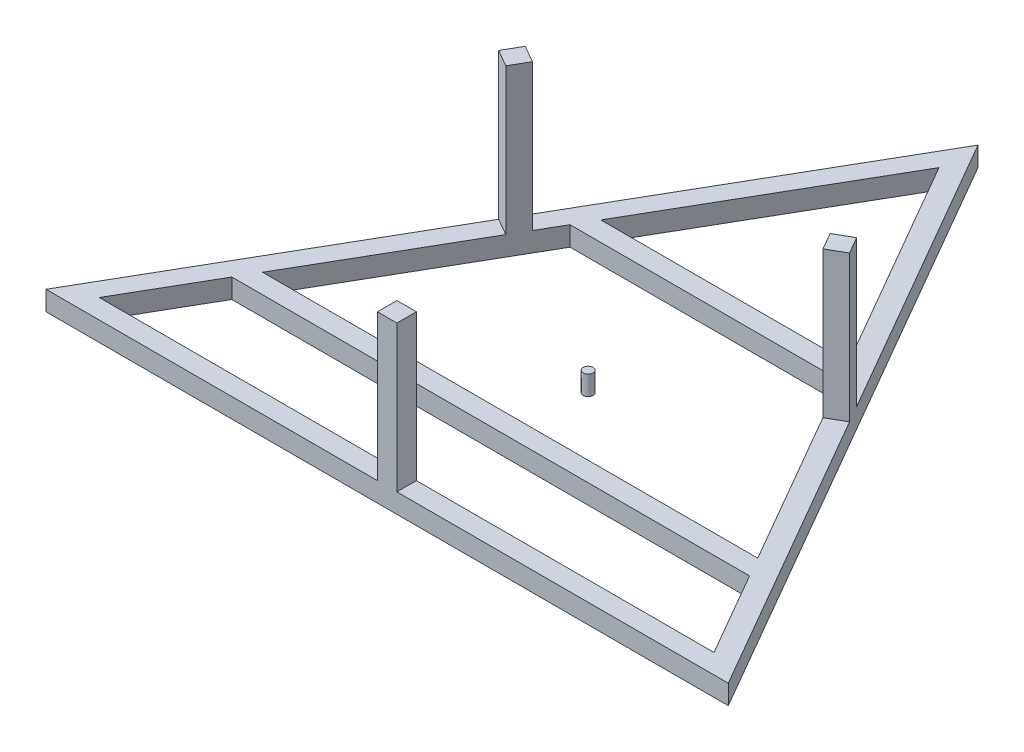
ISO-10303-21;
HEADER;
FILE_DESCRIPTION(('STEP AP214'),'2;1');
FILE_NAME('part.step','',(''),(''),'','','');
FILE_SCHEMA(('AUTOMOTIVE_DESIGN { 1 0 10303 214 1 1 1 1 }'));
ENDSEC;
DATA;
#1=APPLICATION_CONTEXT('core data for automotive mechanical design processes');
#2=APPLICATION_PROTOCOL_DEFINITION('international standard','automotive_design',2000,#1);
#3=PRODUCT_CONTEXT('',#1,'mechanical');
#4=PRODUCT('Part','Part','',(#3));
#5=PRODUCT_RELATED_PRODUCT_CATEGORY('part','',(#4));
#6=PRODUCT_DEFINITION_FORMATION('','',#4);
#7=PRODUCT_DEFINITION_CONTEXT('part definition',#1,'design');
#8=PRODUCT_DEFINITION('design','',#6,#7);
#9=PRODUCT_DEFINITION_SHAPE('','',#8);
#10=(LENGTH_UNIT() NAMED_UNIT(*) SI_UNIT(.MILLI.,.METRE.));
#11=(NAMED_UNIT(*) PLANE_ANGLE_UNIT() SI_UNIT($,.RADIAN.));
#12=(NAMED_UNIT(*) SI_UNIT($,.STERADIAN.) SOLID_ANGLE_UNIT());
#13=UNCERTAINTY_MEASURE_WITH_UNIT(LENGTH_MEASURE(1.E-05),#10,'distance_accuracy_value','');
#14=(GEOMETRIC_REPRESENTATION_CONTEXT(3) GLOBAL_UNCERTAINTY_ASSIGNED_CONTEXT((#13)) GLOBAL_UNIT_ASSIGNED_CONTEXT((#10,
#11,#12)) REPRESENTATION_CONTEXT('',''));
#15=CARTESIAN_POINT('',(0.,0.,0.));
#16=DIRECTION('',(0.,0.,1.));
#17=DIRECTION('',(1.,0.,0.));
#18=AXIS2_PLACEMENT_3D('',#15,#16,#17);
#19=CARTESIAN_POINT('',(0.,0.,0.));
#20=DIRECTION('',(0.,1.,0.));
#21=DIRECTION('',(0.,0.,1.));
#22=AXIS2_PLACEMENT_3D('',#19,#20,#21);
#23=CYLINDRICAL_SURFACE('',#22,5.);
#24=CARTESIAN_POINT('',(0.,0.,0.));
#25=DIRECTION('',(0.,1.,0.));
#26=DIRECTION('',(0.,0.,1.));
#27=AXIS2_PLACEMENT_3D('',#24,#25,#26);
#28=CIRCLE('',#27,5.);
#29=CARTESIAN_POINT('',(0.,0.,5.));
#30=VERTEX_POINT('',#29);
#31=EDGE_CURVE('E11',#30,#30,#28,.T.);
#32=ORIENTED_EDGE('',*,*,#31,.T.);
#33=EDGE_LOOP('',(#32));
#34=FACE_BOUND('',#33,.T.);
#35=CARTESIAN_POINT('',(0.,20.,0.));
#36=DIRECTION('',(0.,1.,0.));
#37=DIRECTION('',(0.,0.,1.));
#38=AXIS2_PLACEMENT_3D('',#35,#36,#37);
#39=CIRCLE('',#38,5.);
#40=CARTESIAN_POINT('',(0.,20.,5.));
#41=VERTEX_POINT('',#40);
#42=EDGE_CURVE('E44',#41,#41,#39,.T.);
#43=ORIENTED_EDGE('',*,*,#42,.F.);
#44=EDGE_LOOP('',(#43));
#45=FACE_BOUND('',#44,.T.);
#46=ADVANCED_FACE('F41',(#34,#45),#23,.T.);
#47=CARTESIAN_POINT('',(0.,0.,0.));
#48=DIRECTION('',(0.,1.,0.));
#49=DIRECTION('',(0.,0.,1.));
#50=AXIS2_PLACEMENT_3D('',#47,#48,#49);
#51=PLANE('',#50);
#52=ORIENTED_EDGE('',*,*,#31,.F.);
#53=EDGE_LOOP('',(#52));
#54=FACE_BOUND('',#53,.T.);
#55=ADVANCED_FACE('F56',(#54),#51,.F.);
#56=CARTESIAN_POINT('',(0.,20.,0.));
#57=DIRECTION('',(0.,1.,0.));
#58=DIRECTION('',(0.,0.,1.));
#59=AXIS2_PLACEMENT_3D('',#56,#57,#58);
#60=PLANE('',#59);
#61=ORIENTED_EDGE('',*,*,#42,.T.);
#62=EDGE_LOOP('',(#61));
#63=FACE_BOUND('',#62,.T.);
#64=ADVANCED_FACE('F53',(#63),#60,.T.);
#65=CLOSED_SHELL('',(#46,#55,#64));
#66=MANIFOLD_SOLID_BREP('B2',#65);
#67=CARTESIAN_POINT('',(0.,20.,0.));
#68=DIRECTION('',(0.,1.,0.));
#69=DIRECTION('',(0.,0.,1.));
#70=AXIS2_PLACEMENT_3D('',#67,#68,#69);
#71=PLANE('',#70);
#72=DIRECTION('',(1.,0.,0.));
#73=VECTOR('',#72,1.);
#74=CARTESIAN_POINT('',(-350.,20.,206.217782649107));
#75=LINE('',#74,#73);
#76=CARTESIAN_POINT('',(-350.,20.,206.217782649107));
#77=VERTEX_POINT('',#76);
#78=CARTESIAN_POINT('',(-9.99999999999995,20.,206.217782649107));
#79=VERTEX_POINT('',#78);
#80=EDGE_CURVE('E426',#77,#79,#75,.T.);
#81=ORIENTED_EDGE('',*,*,#80,.T.);
#82=DIRECTION('',(0.,0.,1.));
#83=VECTOR('',#82,1.);
#84=CARTESIAN_POINT('',(-9.99999999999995,20.,186.217782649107));
#85=LINE('',#84,#83);
#86=CARTESIAN_POINT('',(-9.99999999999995,20.,186.217782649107));
#87=VERTEX_POINT('',#86);
#88=EDGE_CURVE('E486',#87,#79,#85,.T.);
#89=ORIENTED_EDGE('',*,*,#88,.F.);
#90=DIRECTION('',(1.,0.,0.));
#91=VECTOR('',#90,1.);
#92=CARTESIAN_POINT('',(-315.358983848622,20.,186.217782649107));
#93=LINE('',#92,#91);
#94=CARTESIAN_POINT('',(-315.358983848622,20.,186.217782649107));
#95=VERTEX_POINT('',#94);
#96=EDGE_CURVE('E278',#95,#87,#93,.T.);
#97=ORIENTED_EDGE('',*,*,#96,.F.);
#98=DIRECTION('',(-0.5,0.,0.866025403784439));
#99=VECTOR('',#98,1.);
#100=CARTESIAN_POINT('',(-265.581123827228,20.,100.));
#101=LINE('',#100,#99);
#102=CARTESIAN_POINT('',(-265.581123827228,20.,100.));
#103=VERTEX_POINT('',#102);
#104=EDGE_CURVE('E398',#103,#95,#101,.T.);
#105=ORIENTED_EDGE('',*,*,#104,.F.);
#106=DIRECTION('',(-1.,0.,0.));
#107=VECTOR('',#106,1.);
#108=CARTESIAN_POINT('',(-265.581123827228,20.,100.));
#109=LINE('',#108,#107);
#110=CARTESIAN_POINT('',(265.581123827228,20.,100.));
#111=VERTEX_POINT('',#110);
#112=EDGE_CURVE('E395',#111,#103,#109,.T.);
#113=ORIENTED_EDGE('',*,*,#112,.F.);
#114=DIRECTION('',(-0.500000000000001,0.,-0.866025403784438));
#115=VECTOR('',#114,1.);
#116=CARTESIAN_POINT('',(315.358983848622,20.,186.217782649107));
#117=LINE('',#116,#115);
#118=CARTESIAN_POINT('',(315.358983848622,20.,186.217782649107));
#119=VERTEX_POINT('',#118);
#120=EDGE_CURVE('E392',#119,#111,#117,.T.);
#121=ORIENTED_EDGE('',*,*,#120,.F.);
#122=CARTESIAN_POINT('',(10.,20.,186.217782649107));
#123=VERTEX_POINT('',#122);
#124=EDGE_CURVE('E393',#123,#119,#93,.T.);
#125=ORIENTED_EDGE('',*,*,#124,.F.);
#126=DIRECTION('',(0.,0.,-1.));
#127=VECTOR('',#126,1.);
#128=CARTESIAN_POINT('',(10.,20.,186.217782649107));
#129=LINE('',#128,#127);
#130=CARTESIAN_POINT('',(10.,20.,206.217782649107));
#131=VERTEX_POINT('',#130);
#132=EDGE_CURVE('E272',#131,#123,#129,.T.);
#133=ORIENTED_EDGE('',*,*,#132,.F.);
#134=CARTESIAN_POINT('',(350.,20.,206.217782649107));
#135=VERTEX_POINT('',#134);
#136=EDGE_CURVE('E424',#131,#135,#75,.T.);
#137=ORIENTED_EDGE('',*,*,#136,.T.);
#138=DIRECTION('',(-0.5,0.,-0.866025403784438));
#139=VECTOR('',#138,1.);
#140=CARTESIAN_POINT('',(350.,20.,206.217782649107));
#141=LINE('',#140,#139);
#142=CARTESIAN_POINT('',(180.,20.,-88.2308546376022));
#143=VERTEX_POINT('',#142);
#144=EDGE_CURVE('E430',#135,#143,#141,.T.);
#145=ORIENTED_EDGE('',*,*,#144,.T.);
#146=DIRECTION('',(0.866025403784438,0.,-0.500000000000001));
#147=VECTOR('',#146,1.);
#148=CARTESIAN_POINT('',(180.,20.,-88.2308546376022));
#149=LINE('',#148,#147);
#150=CARTESIAN_POINT('',(162.679491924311,20.,-78.2308546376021));
#151=VERTEX_POINT('',#150);
#152=EDGE_CURVE('E281',#151,#143,#149,.T.);
#153=ORIENTED_EDGE('',*,*,#152,.F.);
#154=DIRECTION('',(-0.5,0.,-0.866025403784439));
#155=VECTOR('',#154,1.);
#156=CARTESIAN_POINT('',(254.034118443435,20.,80.));
#157=LINE('',#156,#155);
#158=CARTESIAN_POINT('',(254.034118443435,20.,80.));
#159=VERTEX_POINT('',#158);
#160=EDGE_CURVE('E340',#159,#151,#157,.T.);
#161=ORIENTED_EDGE('',*,*,#160,.F.);
#162=DIRECTION('',(1.,0.,0.));
#163=VECTOR('',#162,1.);
#164=CARTESIAN_POINT('',(-254.034118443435,20.,80.));
#165=LINE('',#164,#163);
#166=CARTESIAN_POINT('',(-254.034118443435,20.,80.));
#167=VERTEX_POINT('',#166);
#168=EDGE_CURVE('E336',#167,#159,#165,.T.);
#169=ORIENTED_EDGE('',*,*,#168,.F.);
#170=DIRECTION('',(-0.5,0.,0.866025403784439));
#171=VECTOR('',#170,1.);
#172=CARTESIAN_POINT('',(-138.56406460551,20.,-120.));
#173=LINE('',#172,#171);
#174=CARTESIAN_POINT('',(-162.679491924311,20.,-78.2308546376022));
#175=VERTEX_POINT('',#174);
#176=EDGE_CURVE('E337',#175,#167,#173,.T.);
#177=ORIENTED_EDGE('',*,*,#176,.F.);
#178=DIRECTION('',(0.866025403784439,0.,0.499999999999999));
#179=VECTOR('',#178,1.);
#180=CARTESIAN_POINT('',(-162.679491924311,20.,-78.2308546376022));
#181=LINE('',#180,#179);
#182=CARTESIAN_POINT('',(-180.,20.,-88.2308546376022));
#183=VERTEX_POINT('',#182);
#184=EDGE_CURVE('E310',#183,#175,#181,.T.);
#185=ORIENTED_EDGE('',*,*,#184,.F.);
#186=DIRECTION('',(-0.5,0.,0.866025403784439));
#187=VECTOR('',#186,1.);
#188=CARTESIAN_POINT('',(0.,20.,-400.));
#189=LINE('',#188,#187);
#190=EDGE_CURVE('E425',#183,#77,#189,.T.);
#191=ORIENTED_EDGE('',*,*,#190,.T.);
#192=EDGE_LOOP('',(#81,#89,#97,#105,#113,#121,#125,#133,#137,#145,#153,#161,#169,#177,#185,#191));
#193=FACE_BOUND('',#192,.T.);
#194=ADVANCED_FACE('F82',(#193),#71,.T.);
#195=DIRECTION('',(-0.5,0.,0.866025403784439));
#196=VECTOR('',#195,1.);
#197=CARTESIAN_POINT('',(0.,20.,-360.));
#198=LINE('',#197,#196);
#199=CARTESIAN_POINT('',(0.,20.,-360.));
#200=VERTEX_POINT('',#199);
#201=CARTESIAN_POINT('',(-127.017059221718,20.,-140.));
#202=VERTEX_POINT('',#201);
#203=EDGE_CURVE('E369',#200,#202,#198,.T.);
#204=ORIENTED_EDGE('',*,*,#203,.F.);
#205=DIRECTION('',(-0.5,0.,-0.866025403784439));
#206=VECTOR('',#205,1.);
#207=CARTESIAN_POINT('',(127.017059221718,20.,-140.));
#208=LINE('',#207,#206);
#209=CARTESIAN_POINT('',(127.017059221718,20.,-140.));
#210=VERTEX_POINT('',#209);
#211=EDGE_CURVE('E367',#210,#200,#208,.T.);
#212=ORIENTED_EDGE('',*,*,#211,.F.);
#213=DIRECTION('',(1.,0.,0.));
#214=VECTOR('',#213,1.);
#215=CARTESIAN_POINT('',(-127.017059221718,20.,-140.));
#216=LINE('',#215,#214);
#217=EDGE_CURVE('E373',#202,#210,#216,.T.);
#218=ORIENTED_EDGE('',*,*,#217,.F.);
#219=EDGE_LOOP('',(#204,#212,#218));
#220=FACE_BOUND('',#219,.T.);
#221=CARTESIAN_POINT('',(152.679491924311,20.,-95.551362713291));
#222=VERTEX_POINT('',#221);
#223=CARTESIAN_POINT('',(138.56406460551,20.,-120.));
#224=VERTEX_POINT('',#223);
#225=EDGE_CURVE('E339',#222,#224,#157,.T.);
#226=ORIENTED_EDGE('',*,*,#225,.F.);
#227=DIRECTION('',(-0.866025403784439,0.,0.5));
#228=VECTOR('',#227,1.);
#229=CARTESIAN_POINT('',(170.,20.,-105.551362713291));
#230=LINE('',#229,#228);
#231=CARTESIAN_POINT('',(170.,20.,-105.551362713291));
#232=VERTEX_POINT('',#231);
#233=EDGE_CURVE('E279',#232,#222,#230,.T.);
#234=ORIENTED_EDGE('',*,*,#233,.F.);
#235=CARTESIAN_POINT('',(0.,20.,-400.));
#236=VERTEX_POINT('',#235);
#237=EDGE_CURVE('E429',#232,#236,#141,.T.);
#238=ORIENTED_EDGE('',*,*,#237,.T.);
#239=CARTESIAN_POINT('',(-170.,20.,-105.551362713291));
#240=VERTEX_POINT('',#239);
#241=EDGE_CURVE('E422',#236,#240,#189,.T.);
#242=ORIENTED_EDGE('',*,*,#241,.T.);
#243=DIRECTION('',(-0.866025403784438,0.,-0.500000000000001));
#244=VECTOR('',#243,1.);
#245=CARTESIAN_POINT('',(-152.679491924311,20.,-95.5513627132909));
#246=LINE('',#245,#244);
#247=CARTESIAN_POINT('',(-152.679491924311,20.,-95.5513627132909));
#248=VERTEX_POINT('',#247);
#249=EDGE_CURVE('E305',#248,#240,#246,.T.);
#250=ORIENTED_EDGE('',*,*,#249,.F.);
#251=CARTESIAN_POINT('',(-138.56406460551,20.,-120.));
#252=VERTEX_POINT('',#251);
#253=EDGE_CURVE('E333',#252,#248,#173,.T.);
#254=ORIENTED_EDGE('',*,*,#253,.F.);
#255=DIRECTION('',(-1.,0.,0.));
#256=VECTOR('',#255,1.);
#257=CARTESIAN_POINT('',(-138.56406460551,20.,-120.));
#258=LINE('',#257,#256);
#259=EDGE_CURVE('E343',#224,#252,#258,.T.);
#260=ORIENTED_EDGE('',*,*,#259,.F.);
#261=EDGE_LOOP('',(#226,#234,#238,#242,#250,#254,#260));
#262=FACE_BOUND('',#261,.T.);
#263=ADVANCED_FACE('F464',(#220,#262),#71,.T.);
#264=CARTESIAN_POINT('',(0.,0.,0.));
#265=DIRECTION('',(0.,1.,0.));
#266=DIRECTION('',(0.,0.,1.));
#267=AXIS2_PLACEMENT_3D('',#264,#265,#266);
#268=PLANE('',#267);
#269=DIRECTION('',(-0.5,0.,-0.866025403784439));
#270=VECTOR('',#269,1.);
#271=CARTESIAN_POINT('',(127.017059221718,0.,-140.));
#272=LINE('',#271,#270);
#273=CARTESIAN_POINT('',(127.017059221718,0.,-140.));
#274=VERTEX_POINT('',#273);
#275=CARTESIAN_POINT('',(0.,0.,-360.));
#276=VERTEX_POINT('',#275);
#277=EDGE_CURVE('E366',#274,#276,#272,.T.);
#278=ORIENTED_EDGE('',*,*,#277,.T.);
#279=DIRECTION('',(-0.5,0.,0.866025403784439));
#280=VECTOR('',#279,1.);
#281=CARTESIAN_POINT('',(0.,0.,-360.));
#282=LINE('',#281,#280);
#283=CARTESIAN_POINT('',(-127.017059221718,0.,-140.));
#284=VERTEX_POINT('',#283);
#285=EDGE_CURVE('E378',#276,#284,#282,.T.);
#286=ORIENTED_EDGE('',*,*,#285,.T.);
#287=DIRECTION('',(1.,0.,0.));
#288=VECTOR('',#287,1.);
#289=CARTESIAN_POINT('',(-127.017059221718,0.,-140.));
#290=LINE('',#289,#288);
#291=EDGE_CURVE('E370',#284,#274,#290,.T.);
#292=ORIENTED_EDGE('',*,*,#291,.T.);
#293=EDGE_LOOP('',(#278,#286,#292));
#294=FACE_BOUND('',#293,.T.);
#295=DIRECTION('',(-0.5,0.,0.866025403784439));
#296=VECTOR('',#295,1.);
#297=CARTESIAN_POINT('',(0.,0.,-400.));
#298=LINE('',#297,#296);
#299=CARTESIAN_POINT('',(0.,0.,-400.));
#300=VERTEX_POINT('',#299);
#301=CARTESIAN_POINT('',(-350.,0.,206.217782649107));
#302=VERTEX_POINT('',#301);
#303=EDGE_CURVE('E421',#300,#302,#298,.T.);
#304=ORIENTED_EDGE('',*,*,#303,.F.);
#305=DIRECTION('',(-0.5,0.,-0.866025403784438));
#306=VECTOR('',#305,1.);
#307=CARTESIAN_POINT('',(350.,0.,206.217782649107));
#308=LINE('',#307,#306);
#309=CARTESIAN_POINT('',(350.,0.,206.217782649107));
#310=VERTEX_POINT('',#309);
#311=EDGE_CURVE('E438',#310,#300,#308,.T.);
#312=ORIENTED_EDGE('',*,*,#311,.F.);
#313=DIRECTION('',(1.,0.,0.));
#314=VECTOR('',#313,1.);
#315=CARTESIAN_POINT('',(-350.,0.,206.217782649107));
#316=LINE('',#315,#314);
#317=EDGE_CURVE('E436',#302,#310,#316,.T.);
#318=ORIENTED_EDGE('',*,*,#317,.F.);
#319=EDGE_LOOP('',(#304,#312,#318));
#320=FACE_BOUND('',#319,.T.);
#321=DIRECTION('',(1.,0.,0.));
#322=VECTOR('',#321,1.);
#323=CARTESIAN_POINT('',(-315.358983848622,0.,186.217782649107));
#324=LINE('',#323,#322);
#325=CARTESIAN_POINT('',(-315.358983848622,0.,186.217782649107));
#326=VERTEX_POINT('',#325);
#327=CARTESIAN_POINT('',(315.358983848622,0.,186.217782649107));
#328=VERTEX_POINT('',#327);
#329=EDGE_CURVE('E390',#326,#328,#324,.T.);
#330=ORIENTED_EDGE('',*,*,#329,.T.);
#331=DIRECTION('',(-0.500000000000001,0.,-0.866025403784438));
#332=VECTOR('',#331,1.);
#333=CARTESIAN_POINT('',(315.358983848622,0.,186.217782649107));
#334=LINE('',#333,#332);
#335=CARTESIAN_POINT('',(265.581123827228,0.,100.));
#336=VERTEX_POINT('',#335);
#337=EDGE_CURVE('E403',#328,#336,#334,.T.);
#338=ORIENTED_EDGE('',*,*,#337,.T.);
#339=DIRECTION('',(-1.,0.,0.));
#340=VECTOR('',#339,1.);
#341=CARTESIAN_POINT('',(-265.581123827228,0.,100.));
#342=LINE('',#341,#340);
#343=CARTESIAN_POINT('',(-265.581123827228,0.,100.));
#344=VERTEX_POINT('',#343);
#345=EDGE_CURVE('E406',#336,#344,#342,.T.);
#346=ORIENTED_EDGE('',*,*,#345,.T.);
#347=DIRECTION('',(-0.5,0.,0.866025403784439));
#348=VECTOR('',#347,1.);
#349=CARTESIAN_POINT('',(-265.581123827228,0.,100.));
#350=LINE('',#349,#348);
#351=EDGE_CURVE('E409',#344,#326,#350,.T.);
#352=ORIENTED_EDGE('',*,*,#351,.T.);
#353=EDGE_LOOP('',(#330,#338,#346,#352));
#354=FACE_BOUND('',#353,.T.);
#355=DIRECTION('',(-0.5,0.,0.866025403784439));
#356=VECTOR('',#355,1.);
#357=CARTESIAN_POINT('',(-138.56406460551,0.,-120.));
#358=LINE('',#357,#356);
#359=CARTESIAN_POINT('',(-138.56406460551,0.,-120.));
#360=VERTEX_POINT('',#359);
#361=CARTESIAN_POINT('',(-254.034118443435,0.,80.));
#362=VERTEX_POINT('',#361);
#363=EDGE_CURVE('E332',#360,#362,#358,.T.);
#364=ORIENTED_EDGE('',*,*,#363,.T.);
#365=DIRECTION('',(1.,0.,0.));
#366=VECTOR('',#365,1.);
#367=CARTESIAN_POINT('',(-254.034118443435,0.,80.));
#368=LINE('',#367,#366);
#369=CARTESIAN_POINT('',(254.034118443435,0.,80.));
#370=VERTEX_POINT('',#369);
#371=EDGE_CURVE('E348',#362,#370,#368,.T.);
#372=ORIENTED_EDGE('',*,*,#371,.T.);
#373=DIRECTION('',(-0.5,0.,-0.866025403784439));
#374=VECTOR('',#373,1.);
#375=CARTESIAN_POINT('',(254.034118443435,0.,80.));
#376=LINE('',#375,#374);
#377=CARTESIAN_POINT('',(138.56406460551,0.,-120.));
#378=VERTEX_POINT('',#377);
#379=EDGE_CURVE('E351',#370,#378,#376,.T.);
#380=ORIENTED_EDGE('',*,*,#379,.T.);
#381=DIRECTION('',(-1.,0.,0.));
#382=VECTOR('',#381,1.);
#383=CARTESIAN_POINT('',(-138.56406460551,0.,-120.));
#384=LINE('',#383,#382);
#385=EDGE_CURVE('E354',#378,#360,#384,.T.);
#386=ORIENTED_EDGE('',*,*,#385,.T.);
#387=EDGE_LOOP('',(#364,#372,#380,#386));
#388=FACE_BOUND('',#387,.T.);
#389=ADVANCED_FACE('F452',(#294,#320,#354,#388),#268,.F.);
#390=CARTESIAN_POINT('',(0.,20.,-400.));
#391=DIRECTION('',(0.866025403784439,0.,0.5));
#392=DIRECTION('',(0.5,0.,-0.866025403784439));
#393=AXIS2_PLACEMENT_3D('',#390,#391,#392);
#394=PLANE('',#393);
#395=ORIENTED_EDGE('',*,*,#303,.T.);
#396=DIRECTION('',(0.,-1.,0.));
#397=VECTOR('',#396,1.);
#398=CARTESIAN_POINT('',(-350.,20.,206.217782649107));
#399=LINE('',#398,#397);
#400=EDGE_CURVE('E39',#77,#302,#399,.T.);
#401=ORIENTED_EDGE('',*,*,#400,.F.);
#402=ORIENTED_EDGE('',*,*,#190,.F.);
#403=DIRECTION('',(0.,-1.,0.));
#404=VECTOR('',#403,1.);
#405=CARTESIAN_POINT('',(-180.,170.,-88.2308546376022));
#406=LINE('',#405,#404);
#407=CARTESIAN_POINT('',(-180.,170.,-88.2308546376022));
#408=VERTEX_POINT('',#407);
#409=EDGE_CURVE('E323',#408,#183,#406,.T.);
#410=ORIENTED_EDGE('',*,*,#409,.F.);
#411=DIRECTION('',(-0.499999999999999,0.,0.866025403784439));
#412=VECTOR('',#411,1.);
#413=CARTESIAN_POINT('',(-170.,170.,-105.551362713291));
#414=LINE('',#413,#412);
#415=CARTESIAN_POINT('',(-170.,170.,-105.551362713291));
#416=VERTEX_POINT('',#415);
#417=EDGE_CURVE('E312',#416,#408,#414,.T.);
#418=ORIENTED_EDGE('',*,*,#417,.F.);
#419=DIRECTION('',(0.,-1.,0.));
#420=VECTOR('',#419,1.);
#421=CARTESIAN_POINT('',(-170.,170.,-105.551362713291));
#422=LINE('',#421,#420);
#423=EDGE_CURVE('E326',#416,#240,#422,.T.);
#424=ORIENTED_EDGE('',*,*,#423,.T.);
#425=ORIENTED_EDGE('',*,*,#241,.F.);
#426=DIRECTION('',(0.,-1.,0.));
#427=VECTOR('',#426,1.);
#428=CARTESIAN_POINT('',(0.,20.,-400.));
#429=LINE('',#428,#427);
#430=EDGE_CURVE('E433',#236,#300,#429,.T.);
#431=ORIENTED_EDGE('',*,*,#430,.T.);
#432=EDGE_LOOP('',(#395,#401,#402,#410,#418,#424,#425,#431));
#433=FACE_BOUND('',#432,.T.);
#434=ADVANCED_FACE('F84',(#433),#394,.F.);
#435=CARTESIAN_POINT('',(-350.,20.,206.217782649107));
#436=DIRECTION('',(0.,0.,-1.));
#437=DIRECTION('',(-1.,0.,0.));
#438=AXIS2_PLACEMENT_3D('',#435,#436,#437);
#439=PLANE('',#438);
#440=ORIENTED_EDGE('',*,*,#317,.T.);
#441=DIRECTION('',(0.,-1.,0.));
#442=VECTOR('',#441,1.);
#443=CARTESIAN_POINT('',(350.,20.,206.217782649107));
#444=LINE('',#443,#442);
#445=EDGE_CURVE('E90',#135,#310,#444,.T.);
#446=ORIENTED_EDGE('',*,*,#445,.F.);
#447=ORIENTED_EDGE('',*,*,#136,.F.);
#448=DIRECTION('',(0.,-1.,0.));
#449=VECTOR('',#448,1.);
#450=CARTESIAN_POINT('',(10.,170.,206.217782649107));
#451=LINE('',#450,#449);
#452=CARTESIAN_POINT('',(10.,170.,206.217782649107));
#453=VERTEX_POINT('',#452);
#454=EDGE_CURVE('E283',#453,#131,#451,.T.);
#455=ORIENTED_EDGE('',*,*,#454,.F.);
#456=DIRECTION('',(1.,0.,0.));
#457=VECTOR('',#456,1.);
#458=CARTESIAN_POINT('',(10.,170.,206.217782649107));
#459=LINE('',#458,#457);
#460=CARTESIAN_POINT('',(-9.99999999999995,170.,206.217782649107));
#461=VERTEX_POINT('',#460);
#462=EDGE_CURVE('E266',#461,#453,#459,.T.);
#463=ORIENTED_EDGE('',*,*,#462,.F.);
#464=DIRECTION('',(0.,-1.,0.));
#465=VECTOR('',#464,1.);
#466=CARTESIAN_POINT('',(-9.99999999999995,170.,206.217782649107));
#467=LINE('',#466,#465);
#468=EDGE_CURVE('E263',#461,#79,#467,.T.);
#469=ORIENTED_EDGE('',*,*,#468,.T.);
#470=ORIENTED_EDGE('',*,*,#80,.F.);
#471=ORIENTED_EDGE('',*,*,#400,.T.);
#472=EDGE_LOOP('',(#440,#446,#447,#455,#463,#469,#470,#471));
#473=FACE_BOUND('',#472,.T.);
#474=ADVANCED_FACE('F479',(#473),#439,.F.);
#475=CARTESIAN_POINT('',(350.,20.,206.217782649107));
#476=DIRECTION('',(-0.866025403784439,0.,0.5));
#477=DIRECTION('',(0.5,0.,0.866025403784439));
#478=AXIS2_PLACEMENT_3D('',#475,#476,#477);
#479=PLANE('',#478);
#480=ORIENTED_EDGE('',*,*,#311,.T.);
#481=ORIENTED_EDGE('',*,*,#430,.F.);
#482=ORIENTED_EDGE('',*,*,#237,.F.);
#483=DIRECTION('',(0.,-1.,0.));
#484=VECTOR('',#483,1.);
#485=CARTESIAN_POINT('',(170.,170.,-105.551362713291));
#486=LINE('',#485,#484);
#487=CARTESIAN_POINT('',(170.,170.,-105.551362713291));
#488=VERTEX_POINT('',#487);
#489=EDGE_CURVE('E303',#488,#232,#486,.T.);
#490=ORIENTED_EDGE('',*,*,#489,.F.);
#491=DIRECTION('',(-0.500000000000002,0.,-0.866025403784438));
#492=VECTOR('',#491,1.);
#493=CARTESIAN_POINT('',(170.,170.,-105.551362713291));
#494=LINE('',#493,#492);
#495=CARTESIAN_POINT('',(180.,170.,-88.2308546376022));
#496=VERTEX_POINT('',#495);
#497=EDGE_CURVE('E287',#496,#488,#494,.T.);
#498=ORIENTED_EDGE('',*,*,#497,.F.);
#499=DIRECTION('',(0.,-1.,0.));
#500=VECTOR('',#499,1.);
#501=CARTESIAN_POINT('',(180.,170.,-88.2308546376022));
#502=LINE('',#501,#500);
#503=EDGE_CURVE('E295',#496,#143,#502,.T.);
#504=ORIENTED_EDGE('',*,*,#503,.T.);
#505=ORIENTED_EDGE('',*,*,#144,.F.);
#506=ORIENTED_EDGE('',*,*,#445,.T.);
#507=EDGE_LOOP('',(#480,#481,#482,#490,#498,#504,#505,#506));
#508=FACE_BOUND('',#507,.T.);
#509=ADVANCED_FACE('F446',(#508),#479,.F.);
#510=CARTESIAN_POINT('',(-315.358983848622,20.,186.217782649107));
#511=DIRECTION('',(0.,0.,-1.));
#512=DIRECTION('',(-1.,0.,0.));
#513=AXIS2_PLACEMENT_3D('',#510,#511,#512);
#514=PLANE('',#513);
#515=ORIENTED_EDGE('',*,*,#329,.F.);
#516=DIRECTION('',(0.,-1.,0.));
#517=VECTOR('',#516,1.);
#518=CARTESIAN_POINT('',(-315.358983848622,20.,186.217782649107));
#519=LINE('',#518,#517);
#520=EDGE_CURVE('E400',#95,#326,#519,.T.);
#521=ORIENTED_EDGE('',*,*,#520,.F.);
#522=ORIENTED_EDGE('',*,*,#96,.T.);
#523=DIRECTION('',(0.,-1.,0.));
#524=VECTOR('',#523,1.);
#525=CARTESIAN_POINT('',(-9.99999999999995,170.,186.217782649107));
#526=LINE('',#525,#524);
#527=CARTESIAN_POINT('',(-9.99999999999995,170.,186.217782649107));
#528=VERTEX_POINT('',#527);
#529=EDGE_CURVE('E260',#528,#87,#526,.T.);
#530=ORIENTED_EDGE('',*,*,#529,.F.);
#531=DIRECTION('',(-1.,0.,0.));
#532=VECTOR('',#531,1.);
#533=CARTESIAN_POINT('',(-9.99999999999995,170.,186.217782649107));
#534=LINE('',#533,#532);
#535=CARTESIAN_POINT('',(10.,170.,186.217782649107));
#536=VERTEX_POINT('',#535);
#537=EDGE_CURVE('E267',#536,#528,#534,.T.);
#538=ORIENTED_EDGE('',*,*,#537,.F.);
#539=DIRECTION('',(0.,-1.,0.));
#540=VECTOR('',#539,1.);
#541=CARTESIAN_POINT('',(10.,170.,186.217782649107));
#542=LINE('',#541,#540);
#543=EDGE_CURVE('E97',#536,#123,#542,.T.);
#544=ORIENTED_EDGE('',*,*,#543,.T.);
#545=ORIENTED_EDGE('',*,*,#124,.T.);
#546=DIRECTION('',(0.,-1.,0.));
#547=VECTOR('',#546,1.);
#548=CARTESIAN_POINT('',(315.358983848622,20.,186.217782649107));
#549=LINE('',#548,#547);
#550=EDGE_CURVE('E418',#119,#328,#549,.T.);
#551=ORIENTED_EDGE('',*,*,#550,.T.);
#552=EDGE_LOOP('',(#515,#521,#522,#530,#538,#544,#545,#551));
#553=FACE_BOUND('',#552,.T.);
#554=ADVANCED_FACE('F275',(#553),#514,.T.);
#555=CARTESIAN_POINT('',(315.358983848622,20.,186.217782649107));
#556=DIRECTION('',(-0.866025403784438,0.,0.500000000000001));
#557=DIRECTION('',(0.500000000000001,0.,0.866025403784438));
#558=AXIS2_PLACEMENT_3D('',#555,#556,#557);
#559=PLANE('',#558);
#560=ORIENTED_EDGE('',*,*,#337,.F.);
#561=ORIENTED_EDGE('',*,*,#550,.F.);
#562=ORIENTED_EDGE('',*,*,#120,.T.);
#563=DIRECTION('',(0.,-1.,0.));
#564=VECTOR('',#563,1.);
#565=CARTESIAN_POINT('',(265.581123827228,20.,100.));
#566=LINE('',#565,#564);
#567=EDGE_CURVE('E416',#111,#336,#566,.T.);
#568=ORIENTED_EDGE('',*,*,#567,.T.);
#569=EDGE_LOOP('',(#560,#561,#562,#568));
#570=FACE_BOUND('',#569,.T.);
#571=ADVANCED_FACE('F492',(#570),#559,.T.);
#572=CARTESIAN_POINT('',(-265.581123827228,20.,100.));
#573=DIRECTION('',(0.,0.,1.));
#574=DIRECTION('',(1.,0.,0.));
#575=AXIS2_PLACEMENT_3D('',#572,#573,#574);
#576=PLANE('',#575);
#577=ORIENTED_EDGE('',*,*,#345,.F.);
#578=ORIENTED_EDGE('',*,*,#567,.F.);
#579=ORIENTED_EDGE('',*,*,#112,.T.);
#580=DIRECTION('',(0.,-1.,0.));
#581=VECTOR('',#580,1.);
#582=CARTESIAN_POINT('',(-265.581123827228,20.,100.));
#583=LINE('',#582,#581);
#584=EDGE_CURVE('E414',#103,#344,#583,.T.);
#585=ORIENTED_EDGE('',*,*,#584,.T.);
#586=EDGE_LOOP('',(#577,#578,#579,#585));
#587=FACE_BOUND('',#586,.T.);
#588=ADVANCED_FACE('F624',(#587),#576,.T.);
#589=CARTESIAN_POINT('',(-265.581123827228,20.,100.));
#590=DIRECTION('',(0.866025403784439,0.,0.5));
#591=DIRECTION('',(0.5,0.,-0.866025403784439));
#592=AXIS2_PLACEMENT_3D('',#589,#590,#591);
#593=PLANE('',#592);
#594=ORIENTED_EDGE('',*,*,#351,.F.);
#595=ORIENTED_EDGE('',*,*,#584,.F.);
#596=ORIENTED_EDGE('',*,*,#104,.T.);
#597=ORIENTED_EDGE('',*,*,#520,.T.);
#598=EDGE_LOOP('',(#594,#595,#596,#597));
#599=FACE_BOUND('',#598,.T.);
#600=ADVANCED_FACE('F498',(#599),#593,.T.);
#601=CARTESIAN_POINT('',(127.017059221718,20.,-140.));
#602=DIRECTION('',(-0.866025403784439,0.,0.5));
#603=DIRECTION('',(0.5,0.,0.866025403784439));
#604=AXIS2_PLACEMENT_3D('',#601,#602,#603);
#605=PLANE('',#604);
#606=ORIENTED_EDGE('',*,*,#277,.F.);
#607=DIRECTION('',(0.,-1.,0.));
#608=VECTOR('',#607,1.);
#609=CARTESIAN_POINT('',(127.017059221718,20.,-140.));
#610=LINE('',#609,#608);
#611=EDGE_CURVE('E375',#210,#274,#610,.T.);
#612=ORIENTED_EDGE('',*,*,#611,.F.);
#613=ORIENTED_EDGE('',*,*,#211,.T.);
#614=DIRECTION('',(0.,-1.,0.));
#615=VECTOR('',#614,1.);
#616=CARTESIAN_POINT('',(0.,20.,-360.));
#617=LINE('',#616,#615);
#618=EDGE_CURVE('E387',#200,#276,#617,.T.);
#619=ORIENTED_EDGE('',*,*,#618,.T.);
#620=EDGE_LOOP('',(#606,#612,#613,#619));
#621=FACE_BOUND('',#620,.T.);
#622=ADVANCED_FACE('F605',(#621),#605,.T.);
#623=CARTESIAN_POINT('',(0.,20.,-360.));
#624=DIRECTION('',(0.866025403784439,0.,0.5));
#625=DIRECTION('',(0.5,0.,-0.866025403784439));
#626=AXIS2_PLACEMENT_3D('',#623,#624,#625);
#627=PLANE('',#626);
#628=ORIENTED_EDGE('',*,*,#285,.F.);
#629=ORIENTED_EDGE('',*,*,#618,.F.);
#630=ORIENTED_EDGE('',*,*,#203,.T.);
#631=DIRECTION('',(0.,-1.,0.));
#632=VECTOR('',#631,1.);
#633=CARTESIAN_POINT('',(-127.017059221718,20.,-140.));
#634=LINE('',#633,#632);
#635=EDGE_CURVE('E385',#202,#284,#634,.T.);
#636=ORIENTED_EDGE('',*,*,#635,.T.);
#637=EDGE_LOOP('',(#628,#629,#630,#636));
#638=FACE_BOUND('',#637,.T.);
#639=ADVANCED_FACE('F595',(#638),#627,.T.);
#640=CARTESIAN_POINT('',(-127.017059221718,20.,-140.));
#641=DIRECTION('',(0.,0.,-1.));
#642=DIRECTION('',(-1.,0.,0.));
#643=AXIS2_PLACEMENT_3D('',#640,#641,#642);
#644=PLANE('',#643);
#645=ORIENTED_EDGE('',*,*,#291,.F.);
#646=ORIENTED_EDGE('',*,*,#635,.F.);
#647=ORIENTED_EDGE('',*,*,#217,.T.);
#648=ORIENTED_EDGE('',*,*,#611,.T.);
#649=EDGE_LOOP('',(#645,#646,#647,#648));
#650=FACE_BOUND('',#649,.T.);
#651=ADVANCED_FACE('F537',(#650),#644,.T.);
#652=CARTESIAN_POINT('',(-138.56406460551,20.,-120.));
#653=DIRECTION('',(0.866025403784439,0.,0.5));
#654=DIRECTION('',(0.5,0.,-0.866025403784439));
#655=AXIS2_PLACEMENT_3D('',#652,#653,#654);
#656=PLANE('',#655);
#657=ORIENTED_EDGE('',*,*,#363,.F.);
#658=DIRECTION('',(0.,-1.,0.));
#659=VECTOR('',#658,1.);
#660=CARTESIAN_POINT('',(-138.56406460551,20.,-120.));
#661=LINE('',#660,#659);
#662=EDGE_CURVE('E345',#252,#360,#661,.T.);
#663=ORIENTED_EDGE('',*,*,#662,.F.);
#664=ORIENTED_EDGE('',*,*,#253,.T.);
#665=DIRECTION('',(0.,-1.,0.));
#666=VECTOR('',#665,1.);
#667=CARTESIAN_POINT('',(-152.679491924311,170.,-95.5513627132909));
#668=LINE('',#667,#666);
#669=CARTESIAN_POINT('',(-152.679491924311,170.,-95.5513627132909));
#670=VERTEX_POINT('',#669);
#671=EDGE_CURVE('E329',#670,#248,#668,.T.);
#672=ORIENTED_EDGE('',*,*,#671,.F.);
#673=DIRECTION('',(0.500000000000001,0.,-0.866025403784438));
#674=VECTOR('',#673,1.);
#675=CARTESIAN_POINT('',(-152.679491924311,170.,-95.5513627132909));
#676=LINE('',#675,#674);
#677=CARTESIAN_POINT('',(-162.679491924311,170.,-78.2308546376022));
#678=VERTEX_POINT('',#677);
#679=EDGE_CURVE('E306',#678,#670,#676,.T.);
#680=ORIENTED_EDGE('',*,*,#679,.F.);
#681=DIRECTION('',(0.,-1.,0.));
#682=VECTOR('',#681,1.);
#683=CARTESIAN_POINT('',(-162.679491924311,170.,-78.2308546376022));
#684=LINE('',#683,#682);
#685=EDGE_CURVE('E316',#678,#175,#684,.T.);
#686=ORIENTED_EDGE('',*,*,#685,.T.);
#687=ORIENTED_EDGE('',*,*,#176,.T.);
#688=DIRECTION('',(0.,-1.,0.));
#689=VECTOR('',#688,1.);
#690=CARTESIAN_POINT('',(-254.034118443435,20.,80.));
#691=LINE('',#690,#689);
#692=EDGE_CURVE('E363',#167,#362,#691,.T.);
#693=ORIENTED_EDGE('',*,*,#692,.T.);
#694=EDGE_LOOP('',(#657,#663,#664,#672,#680,#686,#687,#693));
#695=FACE_BOUND('',#694,.T.);
#696=ADVANCED_FACE('F517',(#695),#656,.T.);
#697=CARTESIAN_POINT('',(-254.034118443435,20.,80.));
#698=DIRECTION('',(0.,0.,-1.));
#699=DIRECTION('',(-1.,0.,0.));
#700=AXIS2_PLACEMENT_3D('',#697,#698,#699);
#701=PLANE('',#700);
#702=ORIENTED_EDGE('',*,*,#371,.F.);
#703=ORIENTED_EDGE('',*,*,#692,.F.);
#704=ORIENTED_EDGE('',*,*,#168,.T.);
#705=DIRECTION('',(0.,-1.,0.));
#706=VECTOR('',#705,1.);
#707=CARTESIAN_POINT('',(254.034118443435,20.,80.));
#708=LINE('',#707,#706);
#709=EDGE_CURVE('E361',#159,#370,#708,.T.);
#710=ORIENTED_EDGE('',*,*,#709,.T.);
#711=EDGE_LOOP('',(#702,#703,#704,#710));
#712=FACE_BOUND('',#711,.T.);
#713=ADVANCED_FACE('F529',(#712),#701,.T.);
#714=CARTESIAN_POINT('',(254.034118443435,20.,80.));
#715=DIRECTION('',(-0.866025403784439,0.,0.5));
#716=DIRECTION('',(0.5,0.,0.866025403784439));
#717=AXIS2_PLACEMENT_3D('',#714,#715,#716);
#718=PLANE('',#717);
#719=ORIENTED_EDGE('',*,*,#379,.F.);
#720=ORIENTED_EDGE('',*,*,#709,.F.);
#721=ORIENTED_EDGE('',*,*,#160,.T.);
#722=DIRECTION('',(0.,-1.,0.));
#723=VECTOR('',#722,1.);
#724=CARTESIAN_POINT('',(162.679491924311,170.,-78.2308546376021));
#725=LINE('',#724,#723);
#726=CARTESIAN_POINT('',(162.679491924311,170.,-78.2308546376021));
#727=VERTEX_POINT('',#726);
#728=EDGE_CURVE('E300',#727,#151,#725,.T.);
#729=ORIENTED_EDGE('',*,*,#728,.F.);
#730=DIRECTION('',(0.5,0.,0.866025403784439));
#731=VECTOR('',#730,1.);
#732=CARTESIAN_POINT('',(152.679491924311,170.,-95.5513627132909));
#733=LINE('',#732,#731);
#734=CARTESIAN_POINT('',(152.679491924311,170.,-95.5513627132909));
#735=VERTEX_POINT('',#734);
#736=EDGE_CURVE('E292',#735,#727,#733,.T.);
#737=ORIENTED_EDGE('',*,*,#736,.F.);
#738=DIRECTION('',(0.,-1.,0.));
#739=VECTOR('',#738,1.);
#740=CARTESIAN_POINT('',(152.679491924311,170.,-95.5513627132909));
#741=LINE('',#740,#739);
#742=EDGE_CURVE('E105',#735,#222,#741,.T.);
#743=ORIENTED_EDGE('',*,*,#742,.T.);
#744=ORIENTED_EDGE('',*,*,#225,.T.);
#745=DIRECTION('',(0.,-1.,0.));
#746=VECTOR('',#745,1.);
#747=CARTESIAN_POINT('',(138.56406460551,20.,-120.));
#748=LINE('',#747,#746);
#749=EDGE_CURVE('E359',#224,#378,#748,.T.);
#750=ORIENTED_EDGE('',*,*,#749,.T.);
#751=EDGE_LOOP('',(#719,#720,#721,#729,#737,#743,#744,#750));
#752=FACE_BOUND('',#751,.T.);
#753=ADVANCED_FACE('F524',(#752),#718,.T.);
#754=CARTESIAN_POINT('',(-138.56406460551,20.,-120.));
#755=DIRECTION('',(0.,0.,1.));
#756=DIRECTION('',(1.,0.,0.));
#757=AXIS2_PLACEMENT_3D('',#754,#755,#756);
#758=PLANE('',#757);
#759=ORIENTED_EDGE('',*,*,#385,.F.);
#760=ORIENTED_EDGE('',*,*,#749,.F.);
#761=ORIENTED_EDGE('',*,*,#259,.T.);
#762=ORIENTED_EDGE('',*,*,#662,.T.);
#763=EDGE_LOOP('',(#759,#760,#761,#762));
#764=FACE_BOUND('',#763,.T.);
#765=ADVANCED_FACE('F520',(#764),#758,.T.);
#766=CARTESIAN_POINT('',(-152.679491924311,170.,-95.5513627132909));
#767=DIRECTION('',(-0.500000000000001,0.,0.866025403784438));
#768=DIRECTION('',(0.866025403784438,0.,0.500000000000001));
#769=AXIS2_PLACEMENT_3D('',#766,#767,#768);
#770=PLANE('',#769);
#771=ORIENTED_EDGE('',*,*,#249,.T.);
#772=ORIENTED_EDGE('',*,*,#423,.F.);
#773=DIRECTION('',(-0.866025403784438,0.,-0.500000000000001));
#774=VECTOR('',#773,1.);
#775=CARTESIAN_POINT('',(-152.679491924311,170.,-95.5513627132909));
#776=LINE('',#775,#774);
#777=EDGE_CURVE('E309',#670,#416,#776,.T.);
#778=ORIENTED_EDGE('',*,*,#777,.F.);
#779=ORIENTED_EDGE('',*,*,#671,.T.);
#780=EDGE_LOOP('',(#771,#772,#778,#779));
#781=FACE_BOUND('',#780,.T.);
#782=ADVANCED_FACE('F513',(#781),#770,.F.);
#783=CARTESIAN_POINT('',(-162.679491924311,170.,-78.2308546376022));
#784=DIRECTION('',(0.499999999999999,0.,-0.866025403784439));
#785=DIRECTION('',(-0.866025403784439,0.,-0.499999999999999));
#786=AXIS2_PLACEMENT_3D('',#783,#784,#785);
#787=PLANE('',#786);
#788=ORIENTED_EDGE('',*,*,#184,.T.);
#789=ORIENTED_EDGE('',*,*,#685,.F.);
#790=DIRECTION('',(0.866025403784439,0.,0.499999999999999));
#791=VECTOR('',#790,1.);
#792=CARTESIAN_POINT('',(-162.679491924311,170.,-78.2308546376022));
#793=LINE('',#792,#791);
#794=EDGE_CURVE('E314',#408,#678,#793,.T.);
#795=ORIENTED_EDGE('',*,*,#794,.F.);
#796=ORIENTED_EDGE('',*,*,#409,.T.);
#797=EDGE_LOOP('',(#788,#789,#795,#796));
#798=FACE_BOUND('',#797,.T.);
#799=ADVANCED_FACE('F505',(#798),#787,.F.);
#800=CARTESIAN_POINT('',(0.,170.,0.));
#801=DIRECTION('',(0.,-1.,0.));
#802=DIRECTION('',(0.,0.,-1.));
#803=AXIS2_PLACEMENT_3D('',#800,#801,#802);
#804=PLANE('',#803);
#805=ORIENTED_EDGE('',*,*,#679,.T.);
#806=ORIENTED_EDGE('',*,*,#777,.T.);
#807=ORIENTED_EDGE('',*,*,#417,.T.);
#808=ORIENTED_EDGE('',*,*,#794,.T.);
#809=EDGE_LOOP('',(#805,#806,#807,#808));
#810=FACE_BOUND('',#809,.T.);
#811=ADVANCED_FACE('F509',(#810),#804,.F.);
#812=CARTESIAN_POINT('',(170.,170.,-105.551362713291));
#813=DIRECTION('',(0.5,0.,0.866025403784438));
#814=DIRECTION('',(0.866025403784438,0.,-0.5));
#815=AXIS2_PLACEMENT_3D('',#812,#813,#814);
#816=PLANE('',#815);
#817=ORIENTED_EDGE('',*,*,#233,.T.);
#818=ORIENTED_EDGE('',*,*,#742,.F.);
#819=DIRECTION('',(-0.866025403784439,0.,0.5));
#820=VECTOR('',#819,1.);
#821=CARTESIAN_POINT('',(170.,170.,-105.551362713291));
#822=LINE('',#821,#820);
#823=EDGE_CURVE('E290',#488,#735,#822,.T.);
#824=ORIENTED_EDGE('',*,*,#823,.F.);
#825=ORIENTED_EDGE('',*,*,#489,.T.);
#826=EDGE_LOOP('',(#817,#818,#824,#825));
#827=FACE_BOUND('',#826,.T.);
#828=ADVANCED_FACE('F467',(#827),#816,.F.);
#829=CARTESIAN_POINT('',(180.,170.,-88.2308546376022));
#830=DIRECTION('',(-0.500000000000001,0.,-0.866025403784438));
#831=DIRECTION('',(-0.866025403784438,0.,0.500000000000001));
#832=AXIS2_PLACEMENT_3D('',#829,#830,#831);
#833=PLANE('',#832);
#834=ORIENTED_EDGE('',*,*,#152,.T.);
#835=ORIENTED_EDGE('',*,*,#503,.F.);
#836=DIRECTION('',(0.866025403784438,0.,-0.500000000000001));
#837=VECTOR('',#836,1.);
#838=CARTESIAN_POINT('',(180.,170.,-88.2308546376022));
#839=LINE('',#838,#837);
#840=EDGE_CURVE('E294',#727,#496,#839,.T.);
#841=ORIENTED_EDGE('',*,*,#840,.F.);
#842=ORIENTED_EDGE('',*,*,#728,.T.);
#843=EDGE_LOOP('',(#834,#835,#841,#842));
#844=FACE_BOUND('',#843,.T.);
#845=ADVANCED_FACE('F716',(#844),#833,.F.);
#846=CARTESIAN_POINT('',(0.,170.,0.));
#847=DIRECTION('',(0.,-1.,0.));
#848=DIRECTION('',(0.,0.,-1.));
#849=AXIS2_PLACEMENT_3D('',#846,#847,#848);
#850=PLANE('',#849);
#851=ORIENTED_EDGE('',*,*,#497,.T.);
#852=ORIENTED_EDGE('',*,*,#823,.T.);
#853=ORIENTED_EDGE('',*,*,#736,.T.);
#854=ORIENTED_EDGE('',*,*,#840,.T.);
#855=EDGE_LOOP('',(#851,#852,#853,#854));
#856=FACE_BOUND('',#855,.T.);
#857=ADVANCED_FACE('F469',(#856),#850,.F.);
#858=CARTESIAN_POINT('',(-9.99999999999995,170.,186.217782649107));
#859=DIRECTION('',(1.,0.,0.));
#860=DIRECTION('',(0.,0.,-1.));
#861=AXIS2_PLACEMENT_3D('',#858,#859,#860);
#862=PLANE('',#861);
#863=ORIENTED_EDGE('',*,*,#88,.T.);
#864=ORIENTED_EDGE('',*,*,#468,.F.);
#865=DIRECTION('',(0.,0.,1.));
#866=VECTOR('',#865,1.);
#867=CARTESIAN_POINT('',(-9.99999999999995,170.,186.217782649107));
#868=LINE('',#867,#866);
#869=EDGE_CURVE('E256',#528,#461,#868,.T.);
#870=ORIENTED_EDGE('',*,*,#869,.F.);
#871=ORIENTED_EDGE('',*,*,#529,.T.);
#872=EDGE_LOOP('',(#863,#864,#870,#871));
#873=FACE_BOUND('',#872,.T.);
#874=ADVANCED_FACE('F258',(#873),#862,.F.);
#875=CARTESIAN_POINT('',(10.,170.,186.217782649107));
#876=DIRECTION('',(-1.,0.,0.));
#877=DIRECTION('',(0.,0.,1.));
#878=AXIS2_PLACEMENT_3D('',#875,#876,#877);
#879=PLANE('',#878);
#880=ORIENTED_EDGE('',*,*,#132,.T.);
#881=ORIENTED_EDGE('',*,*,#543,.F.);
#882=DIRECTION('',(0.,0.,-1.));
#883=VECTOR('',#882,1.);
#884=CARTESIAN_POINT('',(10.,170.,186.217782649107));
#885=LINE('',#884,#883);
#886=EDGE_CURVE('E271',#453,#536,#885,.T.);
#887=ORIENTED_EDGE('',*,*,#886,.F.);
#888=ORIENTED_EDGE('',*,*,#454,.T.);
#889=EDGE_LOOP('',(#880,#881,#887,#888));
#890=FACE_BOUND('',#889,.T.);
#891=ADVANCED_FACE('F481',(#890),#879,.F.);
#892=CARTESIAN_POINT('',(0.,170.,0.));
#893=DIRECTION('',(0.,-1.,0.));
#894=DIRECTION('',(0.,0.,-1.));
#895=AXIS2_PLACEMENT_3D('',#892,#893,#894);
#896=PLANE('',#895);
#897=ORIENTED_EDGE('',*,*,#537,.T.);
#898=ORIENTED_EDGE('',*,*,#869,.T.);
#899=ORIENTED_EDGE('',*,*,#462,.T.);
#900=ORIENTED_EDGE('',*,*,#886,.T.);
#901=EDGE_LOOP('',(#897,#898,#899,#900));
#902=FACE_BOUND('',#901,.T.);
#903=ADVANCED_FACE('F269',(#902),#896,.F.);
#904=CLOSED_SHELL('',(#194,#263,#389,#434,#474,#509,#554,#571,#588,#600,#622,#639,#651,#696,
#713,#753,#765,#782,#799,#811,#828,#845,#857,#874,#891,#903));
#905=MANIFOLD_SOLID_BREP('B6',#904);
#906=ADVANCED_BREP_SHAPE_REPRESENTATION('',(#18,#66,#905),#14);
#907=SHAPE_DEFINITION_REPRESENTATION(#9,#906);
ENDSEC;
END-ISO-10303-21;
